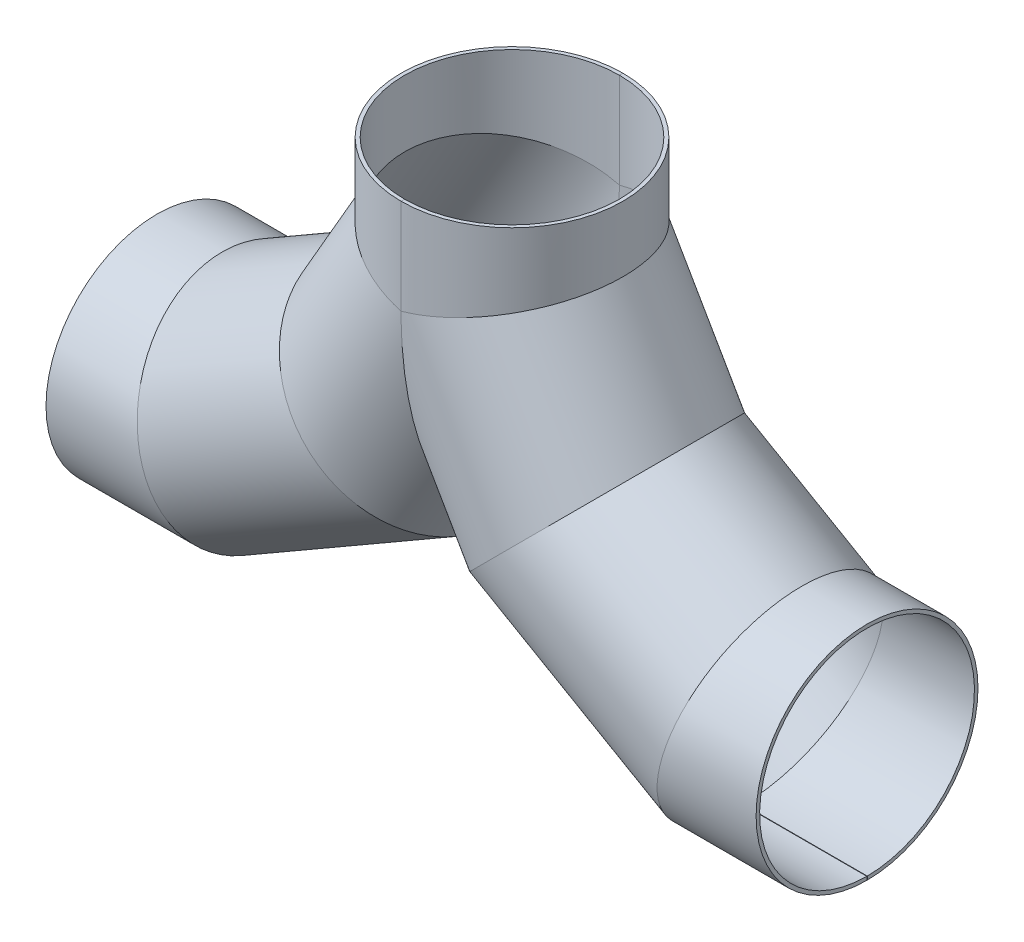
ISO-10303-21;
HEADER;
FILE_DESCRIPTION(('STEP AP214'),'2;1');
FILE_NAME('part.step','',(''),(''),'','','');
FILE_SCHEMA(('AUTOMOTIVE_DESIGN { 1 0 10303 214 1 1 1 1 }'));
ENDSEC;
DATA;
#1=APPLICATION_CONTEXT('core data for automotive mechanical design processes');
#2=APPLICATION_PROTOCOL_DEFINITION('international standard','automotive_design',2000,#1);
#3=PRODUCT_CONTEXT('',#1,'mechanical');
#4=PRODUCT('Part','Part','',(#3));
#5=PRODUCT_RELATED_PRODUCT_CATEGORY('part','',(#4));
#6=PRODUCT_DEFINITION_FORMATION('','',#4);
#7=PRODUCT_DEFINITION_CONTEXT('part definition',#1,'design');
#8=PRODUCT_DEFINITION('design','',#6,#7);
#9=PRODUCT_DEFINITION_SHAPE('','',#8);
#10=(LENGTH_UNIT() NAMED_UNIT(*) SI_UNIT(.MILLI.,.METRE.));
#11=(NAMED_UNIT(*) PLANE_ANGLE_UNIT() SI_UNIT($,.RADIAN.));
#12=(NAMED_UNIT(*) SI_UNIT($,.STERADIAN.) SOLID_ANGLE_UNIT());
#13=UNCERTAINTY_MEASURE_WITH_UNIT(LENGTH_MEASURE(1.E-05),#10,'distance_accuracy_value','');
#14=(GEOMETRIC_REPRESENTATION_CONTEXT(3) GLOBAL_UNCERTAINTY_ASSIGNED_CONTEXT((#13)) GLOBAL_UNIT_ASSIGNED_CONTEXT((#10,
#11,#12)) REPRESENTATION_CONTEXT('',''));
#15=CARTESIAN_POINT('',(0.,0.,0.));
#16=DIRECTION('',(0.,0.,1.));
#17=DIRECTION('',(1.,0.,0.));
#18=AXIS2_PLACEMENT_3D('',#15,#16,#17);
#19=CARTESIAN_POINT('',(0.,-1050.,2271.05453316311));
#20=DIRECTION('',(1.,0.,0.));
#21=DIRECTION('',(0.,0.,1.));
#22=AXIS2_PLACEMENT_3D('',#19,#20,#21);
#23=PLANE('',#22);
#24=DIRECTION('',(0.,1.,0.));
#25=VECTOR('',#24,1.);
#26=CARTESIAN_POINT('',(0.,-281.346652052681,250.));
#27=LINE('',#26,#25);
#28=CARTESIAN_POINT('',(0.,0.,250.));
#29=VERTEX_POINT('',#28);
#30=CARTESIAN_POINT('',(0.,-214.3593539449,250.));
#31=VERTEX_POINT('',#30);
#32=EDGE_CURVE('E133',#29,#31,#27,.F.);
#33=ORIENTED_EDGE('',*,*,#32,.T.);
#34=DIRECTION('',(0.,0.,-1.));
#35=VECTOR('',#34,1.);
#36=CARTESIAN_POINT('',(0.,-214.3593539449,2271.05495199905));
#37=LINE('',#36,#35);
#38=CARTESIAN_POINT('',(0.,-214.3593539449,242.000000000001));
#39=VERTEX_POINT('',#38);
#40=EDGE_CURVE('E13',#31,#39,#37,.T.);
#41=ORIENTED_EDGE('',*,*,#40,.T.);
#42=DIRECTION('',(0.,1.,0.));
#43=VECTOR('',#42,1.);
#44=CARTESIAN_POINT('',(0.,-281.346652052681,242.));
#45=LINE('',#44,#43);
#46=CARTESIAN_POINT('',(0.,0.,242.));
#47=VERTEX_POINT('',#46);
#48=EDGE_CURVE('E134',#47,#39,#45,.F.);
#49=ORIENTED_EDGE('',*,*,#48,.F.);
#50=DIRECTION('',(0.,0.,-1.));
#51=VECTOR('',#50,1.);
#52=CARTESIAN_POINT('',(0.,0.,2271.05453316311));
#53=LINE('',#52,#51);
#54=EDGE_CURVE('E123',#29,#47,#53,.T.);
#55=ORIENTED_EDGE('',*,*,#54,.F.);
#56=EDGE_LOOP('',(#33,#41,#49,#55));
#57=FACE_BOUND('',#56,.T.);
#58=ADVANCED_FACE('F77',(#57),#23,.T.);
#59=CARTESIAN_POINT('',(0.,-281.346652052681,0.));
#60=DIRECTION('',(0.,1.,0.));
#61=DIRECTION('',(0.,0.,1.));
#62=AXIS2_PLACEMENT_3D('',#59,#60,#61);
#63=CYLINDRICAL_SURFACE('',#62,250.);
#64=CARTESIAN_POINT('',(0.,0.,0.));
#65=DIRECTION('',(0.,-1.,0.));
#66=DIRECTION('',(0.,0.,1.));
#67=AXIS2_PLACEMENT_3D('',#64,#65,#66);
#68=CIRCLE('',#67,250.);
#69=CARTESIAN_POINT('',(0.,0.,-250.));
#70=VERTEX_POINT('',#69);
#71=EDGE_CURVE('E119',#29,#70,#68,.T.);
#72=ORIENTED_EDGE('',*,*,#71,.T.);
#73=DIRECTION('',(0.,1.,0.));
#74=VECTOR('',#73,1.);
#75=CARTESIAN_POINT('',(0.,-281.346652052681,-250.));
#76=LINE('',#75,#74);
#77=CARTESIAN_POINT('',(0.,-214.3593539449,-249.999999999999));
#78=VERTEX_POINT('',#77);
#79=EDGE_CURVE('E140',#78,#70,#76,.T.);
#80=ORIENTED_EDGE('',*,*,#79,.F.);
#81=CARTESIAN_POINT('',(0.,-214.3593539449,0.));
#82=DIRECTION('',(0.258819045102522,0.965925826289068,0.));
#83=DIRECTION('',(-0.965925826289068,0.258819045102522,0.));
#84=AXIS2_PLACEMENT_3D('',#81,#82,#83);
#85=ELLIPSE('',#84,258.819045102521,250.);
#86=EDGE_CURVE('E137',#31,#78,#85,.F.);
#87=ORIENTED_EDGE('',*,*,#86,.F.);
#88=ORIENTED_EDGE('',*,*,#32,.F.);
#89=EDGE_LOOP('',(#72,#80,#87,#88));
#90=FACE_BOUND('',#89,.T.);
#91=ADVANCED_FACE('F79',(#90),#63,.T.);
#92=CARTESIAN_POINT('',(0.,-281.346652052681,0.));
#93=DIRECTION('',(0.,1.,0.));
#94=DIRECTION('',(0.,0.,1.));
#95=AXIS2_PLACEMENT_3D('',#92,#93,#94);
#96=CYLINDRICAL_SURFACE('',#95,242.);
#97=ORIENTED_EDGE('',*,*,#48,.T.);
#98=CARTESIAN_POINT('',(0.,-214.3593539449,0.));
#99=DIRECTION('',(0.258819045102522,0.965925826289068,0.));
#100=DIRECTION('',(-0.965925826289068,0.258819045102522,0.));
#101=AXIS2_PLACEMENT_3D('',#98,#99,#100);
#102=ELLIPSE('',#101,250.53683565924,242.);
#103=CARTESIAN_POINT('',(0.,-214.3593539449,-241.999999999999));
#104=VERTEX_POINT('',#103);
#105=EDGE_CURVE('E92',#39,#104,#102,.F.);
#106=ORIENTED_EDGE('',*,*,#105,.T.);
#107=DIRECTION('',(0.,1.,0.));
#108=VECTOR('',#107,1.);
#109=CARTESIAN_POINT('',(0.,-281.346652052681,-242.));
#110=LINE('',#109,#108);
#111=CARTESIAN_POINT('',(0.,0.,-242.));
#112=VERTEX_POINT('',#111);
#113=EDGE_CURVE('E135',#104,#112,#110,.T.);
#114=ORIENTED_EDGE('',*,*,#113,.T.);
#115=CARTESIAN_POINT('',(0.,0.,0.));
#116=DIRECTION('',(0.,-1.,0.));
#117=DIRECTION('',(-1.,0.,0.));
#118=AXIS2_PLACEMENT_3D('',#115,#116,#117);
#119=CIRCLE('',#118,242.);
#120=EDGE_CURVE('E129',#47,#112,#119,.T.);
#121=ORIENTED_EDGE('',*,*,#120,.F.);
#122=EDGE_LOOP('',(#97,#106,#114,#121));
#123=FACE_BOUND('',#122,.T.);
#124=ADVANCED_FACE('F146',(#123),#96,.F.);
#125=CARTESIAN_POINT('',(0.,0.,0.));
#126=DIRECTION('',(0.,1.,0.));
#127=DIRECTION('',(0.,0.,1.));
#128=AXIS2_PLACEMENT_3D('',#125,#126,#127);
#129=PLANE('',#128);
#130=ORIENTED_EDGE('',*,*,#71,.F.);
#131=ORIENTED_EDGE('',*,*,#54,.T.);
#132=ORIENTED_EDGE('',*,*,#120,.T.);
#133=EDGE_CURVE('E125',#112,#70,#53,.T.);
#134=ORIENTED_EDGE('',*,*,#133,.T.);
#135=EDGE_LOOP('',(#130,#131,#132,#134));
#136=FACE_BOUND('',#135,.T.);
#137=ADVANCED_FACE('F121',(#136),#129,.T.);
#138=CARTESIAN_POINT('',(-800.,0.,2271.05495199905));
#139=DIRECTION('',(-0.258819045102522,-0.965925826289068,0.));
#140=DIRECTION('',(-0.965925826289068,0.258819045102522,0.));
#141=AXIS2_PLACEMENT_3D('',#138,#139,#140);
#142=PLANE('',#141);
#143=ORIENTED_EDGE('',*,*,#86,.T.);
#144=EDGE_CURVE('E81',#104,#78,#37,.T.);
#145=ORIENTED_EDGE('',*,*,#144,.F.);
#146=ORIENTED_EDGE('',*,*,#105,.F.);
#147=ORIENTED_EDGE('',*,*,#40,.F.);
#148=EDGE_LOOP('',(#143,#145,#146,#147));
#149=FACE_BOUND('',#148,.T.);
#150=ADVANCED_FACE('F147',(#149),#142,.T.);
#151=ORIENTED_EDGE('',*,*,#79,.T.);
#152=ORIENTED_EDGE('',*,*,#133,.F.);
#153=ORIENTED_EDGE('',*,*,#113,.F.);
#154=ORIENTED_EDGE('',*,*,#144,.T.);
#155=EDGE_LOOP('',(#151,#152,#153,#154));
#156=FACE_BOUND('',#155,.T.);
#157=ADVANCED_FACE('F149',(#156),#23,.T.);
#158=CLOSED_SHELL('',(#58,#91,#124,#137,#150,#157));
#159=MANIFOLD_SOLID_BREP('B2',#158);
#160=CARTESIAN_POINT('',(33.49364905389,-156.34665205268,0.));
#161=DIRECTION('',(-0.5,-0.866025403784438,0.));
#162=DIRECTION('',(-0.866025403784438,0.500000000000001,0.));
#163=AXIS2_PLACEMENT_3D('',#160,#161,#162);
#164=CYLINDRICAL_SURFACE('',#163,250.);
#165=DIRECTION('',(-0.5,-0.866025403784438,0.));
#166=VECTOR('',#165,1.);
#167=CARTESIAN_POINT('',(249.999566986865,-281.346402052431,-0.500000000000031));
#168=LINE('',#167,#166);
#169=CARTESIAN_POINT('',(-31.3470180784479,-768.652981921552,-0.500000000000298));
#170=VERTEX_POINT('',#169);
#171=CARTESIAN_POINT('',(0.,-714.358353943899,-0.500000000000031));
#172=VERTEX_POINT('',#171);
#173=EDGE_CURVE('E278',#170,#172,#168,.F.);
#174=ORIENTED_EDGE('',*,*,#173,.F.);
#175=CARTESIAN_POINT('',(-214.359353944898,-585.640646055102,0.));
#176=DIRECTION('',(0.707106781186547,0.707106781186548,0.));
#177=DIRECTION('',(0.707106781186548,-0.707106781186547,0.));
#178=AXIS2_PLACEMENT_3D('',#175,#176,#177);
#179=ELLIPSE('',#178,258.819045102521,250.);
#180=CARTESIAN_POINT('',(-31.3470180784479,-768.652981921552,0.500000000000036));
#181=VERTEX_POINT('',#180);
#182=EDGE_CURVE('E274',#181,#170,#179,.F.);
#183=ORIENTED_EDGE('',*,*,#182,.F.);
#184=DIRECTION('',(-0.5,-0.866025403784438,0.));
#185=VECTOR('',#184,1.);
#186=CARTESIAN_POINT('',(249.999566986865,-281.346402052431,0.499999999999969));
#187=LINE('',#186,#185);
#188=CARTESIAN_POINT('',(0.,-714.358353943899,0.499999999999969));
#189=VERTEX_POINT('',#188);
#190=EDGE_CURVE('E259',#181,#189,#187,.F.);
#191=ORIENTED_EDGE('',*,*,#190,.T.);
#192=CARTESIAN_POINT('',(0.,-214.359353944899,0.));
#193=DIRECTION('',(-1.,0.,0.));
#194=DIRECTION('',(0.,-1.,0.));
#195=AXIS2_PLACEMENT_3D('',#192,#193,#194);
#196=ELLIPSE('',#195,500.,250.);
#197=CARTESIAN_POINT('',(0.,-214.3593539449,250.000000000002));
#198=VERTEX_POINT('',#197);
#199=EDGE_CURVE('E265',#198,#189,#196,.F.);
#200=ORIENTED_EDGE('',*,*,#199,.F.);
#201=CARTESIAN_POINT('',(-2.63677968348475E-13,-214.3593539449,0.));
#202=DIRECTION('',(0.258819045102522,0.965925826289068,0.));
#203=DIRECTION('',(-0.965925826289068,0.258819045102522,0.));
#204=AXIS2_PLACEMENT_3D('',#201,#202,#203);
#205=ELLIPSE('',#204,258.819045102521,250.);
#206=CARTESIAN_POINT('',(0.,-214.3593539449,-250.));
#207=VERTEX_POINT('',#206);
#208=EDGE_CURVE('E285',#198,#207,#205,.F.);
#209=ORIENTED_EDGE('',*,*,#208,.T.);
#210=EDGE_CURVE('E271',#172,#207,#196,.F.);
#211=ORIENTED_EDGE('',*,*,#210,.F.);
#212=EDGE_LOOP('',(#174,#183,#191,#200,#209,#211));
#213=FACE_BOUND('',#212,.T.);
#214=ADVANCED_FACE('F207',(#213),#164,.T.);
#215=CARTESIAN_POINT('',(33.49364905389,-156.34665205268,0.));
#216=DIRECTION('',(-0.5,-0.866025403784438,0.));
#217=DIRECTION('',(-0.866025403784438,0.500000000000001,0.));
#218=AXIS2_PLACEMENT_3D('',#215,#216,#217);
#219=CYLINDRICAL_SURFACE('',#218,242.);
#220=CARTESIAN_POINT('',(0.,-214.359353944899,0.));
#221=DIRECTION('',(-1.,0.,0.));
#222=DIRECTION('',(0.,-1.,0.));
#223=AXIS2_PLACEMENT_3D('',#220,#221,#222);
#224=ELLIPSE('',#223,484.,242.);
#225=CARTESIAN_POINT('',(0.,-698.358320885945,-0.50000000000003));
#226=VERTEX_POINT('',#225);
#227=CARTESIAN_POINT('',(0.,-214.3593539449,-242.));
#228=VERTEX_POINT('',#227);
#229=EDGE_CURVE('E299',#226,#228,#224,.F.);
#230=ORIENTED_EDGE('',*,*,#229,.T.);
#231=CARTESIAN_POINT('',(-2.63677968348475E-13,-214.3593539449,0.));
#232=DIRECTION('',(0.258819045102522,0.965925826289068,0.));
#233=DIRECTION('',(-0.965925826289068,0.258819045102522,0.));
#234=AXIS2_PLACEMENT_3D('',#231,#232,#233);
#235=ELLIPSE('',#234,250.53683565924,242.);
#236=CARTESIAN_POINT('',(0.,-214.3593539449,242.000000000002));
#237=VERTEX_POINT('',#236);
#238=EDGE_CURVE('E276',#237,#228,#235,.F.);
#239=ORIENTED_EDGE('',*,*,#238,.F.);
#240=CARTESIAN_POINT('',(0.,-698.358320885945,0.49999999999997));
#241=VERTEX_POINT('',#240);
#242=EDGE_CURVE('E269',#237,#241,#224,.F.);
#243=ORIENTED_EDGE('',*,*,#242,.T.);
#244=DIRECTION('',(-0.5,-0.866025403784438,0.));
#245=VECTOR('',#244,1.);
#246=CARTESIAN_POINT('',(243.071349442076,-277.346393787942,0.49999999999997));
#247=LINE('',#246,#245);
#248=CARTESIAN_POINT('',(-37.2034366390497,-762.79656336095,0.500000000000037));
#249=VERTEX_POINT('',#248);
#250=EDGE_CURVE('E262',#249,#241,#247,.F.);
#251=ORIENTED_EDGE('',*,*,#250,.F.);
#252=CARTESIAN_POINT('',(-214.359353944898,-585.640646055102,0.));
#253=DIRECTION('',(0.707106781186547,0.707106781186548,0.));
#254=DIRECTION('',(0.707106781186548,-0.707106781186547,0.));
#255=AXIS2_PLACEMENT_3D('',#252,#253,#254);
#256=ELLIPSE('',#255,250.53683565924,242.);
#257=CARTESIAN_POINT('',(-37.2034366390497,-762.79656336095,-0.500000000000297));
#258=VERTEX_POINT('',#257);
#259=EDGE_CURVE('E282',#249,#258,#256,.F.);
#260=ORIENTED_EDGE('',*,*,#259,.T.);
#261=DIRECTION('',(-0.5,-0.866025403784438,0.));
#262=VECTOR('',#261,1.);
#263=CARTESIAN_POINT('',(243.071349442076,-277.346393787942,-0.50000000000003));
#264=LINE('',#263,#262);
#265=EDGE_CURVE('E309',#258,#226,#264,.F.);
#266=ORIENTED_EDGE('',*,*,#265,.T.);
#267=EDGE_LOOP('',(#230,#239,#243,#251,#260,#266));
#268=FACE_BOUND('',#267,.T.);
#269=ADVANCED_FACE('F296',(#268),#219,.F.);
#270=CARTESIAN_POINT('',(-800.,0.,2271.05495199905));
#271=DIRECTION('',(-0.258819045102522,-0.965925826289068,0.));
#272=DIRECTION('',(-0.965925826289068,0.258819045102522,0.));
#273=AXIS2_PLACEMENT_3D('',#270,#271,#272);
#274=PLANE('',#273);
#275=DIRECTION('',(0.,0.,-1.));
#276=VECTOR('',#275,1.);
#277=CARTESIAN_POINT('',(0.,-214.3593539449,2271.05495199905));
#278=LINE('',#277,#276);
#279=EDGE_CURVE('E221',#198,#237,#278,.T.);
#280=ORIENTED_EDGE('',*,*,#279,.T.);
#281=ORIENTED_EDGE('',*,*,#238,.T.);
#282=EDGE_CURVE('E303',#228,#207,#278,.T.);
#283=ORIENTED_EDGE('',*,*,#282,.T.);
#284=ORIENTED_EDGE('',*,*,#208,.F.);
#285=EDGE_LOOP('',(#280,#281,#283,#284));
#286=FACE_BOUND('',#285,.T.);
#287=ADVANCED_FACE('F314',(#286),#274,.F.);
#288=CARTESIAN_POINT('',(155.320323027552,54.6633369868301,-0.5));
#289=DIRECTION('',(0.,0.,1.));
#290=DIRECTION('',(-1.,0.,0.));
#291=AXIS2_PLACEMENT_3D('',#288,#289,#290);
#292=PLANE('',#291);
#293=ORIENTED_EDGE('',*,*,#265,.F.);
#294=DIRECTION('',(0.707106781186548,-0.707106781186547,0.));
#295=VECTOR('',#294,1.);
#296=CARTESIAN_POINT('',(-800.,1.93782600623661E-13,-0.500000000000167));
#297=LINE('',#296,#295);
#298=EDGE_CURVE('E284',#258,#170,#297,.T.);
#299=ORIENTED_EDGE('',*,*,#298,.T.);
#300=ORIENTED_EDGE('',*,*,#173,.T.);
#301=DIRECTION('',(0.,-1.,0.));
#302=VECTOR('',#301,1.);
#303=CARTESIAN_POINT('',(0.,54.6633369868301,-0.499999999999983));
#304=LINE('',#303,#302);
#305=EDGE_CURVE('E300',#226,#172,#304,.T.);
#306=ORIENTED_EDGE('',*,*,#305,.F.);
#307=EDGE_LOOP('',(#293,#299,#300,#306));
#308=FACE_BOUND('',#307,.T.);
#309=ADVANCED_FACE('F312',(#308),#292,.T.);
#310=CARTESIAN_POINT('',(155.320323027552,54.6633369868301,0.5));
#311=DIRECTION('',(0.,0.,1.));
#312=DIRECTION('',(-1.,0.,0.));
#313=AXIS2_PLACEMENT_3D('',#310,#311,#312);
#314=PLANE('',#313);
#315=DIRECTION('',(0.,-1.,0.));
#316=VECTOR('',#315,1.);
#317=CARTESIAN_POINT('',(0.,54.6633369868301,0.500000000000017));
#318=LINE('',#317,#316);
#319=EDGE_CURVE('E75',#241,#189,#318,.T.);
#320=ORIENTED_EDGE('',*,*,#319,.T.);
#321=ORIENTED_EDGE('',*,*,#190,.F.);
#322=DIRECTION('',(0.707106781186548,-0.707106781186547,0.));
#323=VECTOR('',#322,1.);
#324=CARTESIAN_POINT('',(-800.,1.93697292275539E-13,0.500000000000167));
#325=LINE('',#324,#323);
#326=EDGE_CURVE('E214',#249,#181,#325,.T.);
#327=ORIENTED_EDGE('',*,*,#326,.F.);
#328=ORIENTED_EDGE('',*,*,#250,.T.);
#329=EDGE_LOOP('',(#320,#321,#327,#328));
#330=FACE_BOUND('',#329,.T.);
#331=ADVANCED_FACE('F257',(#330),#314,.F.);
#332=CARTESIAN_POINT('',(-800.,0.,2271.05495199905));
#333=DIRECTION('',(-0.707106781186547,-0.707106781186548,0.));
#334=DIRECTION('',(-0.707106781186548,0.707106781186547,0.));
#335=AXIS2_PLACEMENT_3D('',#332,#333,#334);
#336=PLANE('',#335);
#337=ORIENTED_EDGE('',*,*,#326,.T.);
#338=ORIENTED_EDGE('',*,*,#182,.T.);
#339=ORIENTED_EDGE('',*,*,#298,.F.);
#340=ORIENTED_EDGE('',*,*,#259,.F.);
#341=EDGE_LOOP('',(#337,#338,#339,#340));
#342=FACE_BOUND('',#341,.T.);
#343=ADVANCED_FACE('F291',(#342),#336,.T.);
#344=CARTESIAN_POINT('',(0.,-1050.,2271.05453316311));
#345=DIRECTION('',(1.,0.,0.));
#346=DIRECTION('',(0.,0.,1.));
#347=AXIS2_PLACEMENT_3D('',#344,#345,#346);
#348=PLANE('',#347);
#349=ORIENTED_EDGE('',*,*,#199,.T.);
#350=ORIENTED_EDGE('',*,*,#319,.F.);
#351=ORIENTED_EDGE('',*,*,#242,.F.);
#352=ORIENTED_EDGE('',*,*,#279,.F.);
#353=EDGE_LOOP('',(#349,#350,#351,#352));
#354=FACE_BOUND('',#353,.T.);
#355=ADVANCED_FACE('F266',(#354),#348,.T.);
#356=ORIENTED_EDGE('',*,*,#229,.F.);
#357=ORIENTED_EDGE('',*,*,#305,.T.);
#358=ORIENTED_EDGE('',*,*,#210,.T.);
#359=ORIENTED_EDGE('',*,*,#282,.F.);
#360=EDGE_LOOP('',(#356,#357,#358,#359));
#361=FACE_BOUND('',#360,.T.);
#362=ADVANCED_FACE('F313',(#361),#348,.T.);
#363=CLOSED_SHELL('',(#214,#269,#287,#309,#331,#343,#355,#362));
#364=MANIFOLD_SOLID_BREP('B7',#363);
#365=CARTESIAN_POINT('',(-156.346652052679,-552.146997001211,0.));
#366=DIRECTION('',(-0.866025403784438,-0.500000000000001,0.));
#367=DIRECTION('',(-0.500000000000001,0.866025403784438,0.));
#368=AXIS2_PLACEMENT_3D('',#365,#366,#367);
#369=CYLINDRICAL_SURFACE('',#368,249.999999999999);
#370=DIRECTION('',(-0.866025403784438,-0.500000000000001,0.));
#371=VECTOR('',#370,1.);
#372=CARTESIAN_POINT('',(-31.3469020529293,-768.652914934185,0.499999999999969));
#373=LINE('',#372,#371);
#374=CARTESIAN_POINT('',(-518.65348192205,-1049.9994999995,0.500000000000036));
#375=VERTEX_POINT('',#374);
#376=CARTESIAN_POINT('',(-31.3470180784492,-768.65298192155,0.499999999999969));
#377=VERTEX_POINT('',#376);
#378=EDGE_CURVE('E457',#375,#377,#373,.F.);
#379=ORIENTED_EDGE('',*,*,#378,.T.);
#380=CARTESIAN_POINT('',(-214.359353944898,-585.640646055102,0.));
#381=DIRECTION('',(0.707106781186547,0.707106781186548,0.));
#382=DIRECTION('',(-0.707106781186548,0.707106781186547,0.));
#383=AXIS2_PLACEMENT_3D('',#380,#381,#382);
#384=ELLIPSE('',#383,258.81904510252,249.999999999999);
#385=CARTESIAN_POINT('',(-31.3470180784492,-768.65298192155,-0.500000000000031));
#386=VERTEX_POINT('',#385);
#387=EDGE_CURVE('E443',#377,#386,#384,.F.);
#388=ORIENTED_EDGE('',*,*,#387,.T.);
#389=DIRECTION('',(-0.866025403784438,-0.500000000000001,0.));
#390=VECTOR('',#389,1.);
#391=CARTESIAN_POINT('',(-31.3469020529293,-768.652914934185,-0.500000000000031));
#392=LINE('',#391,#390);
#393=CARTESIAN_POINT('',(-518.65348192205,-1049.9994999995,-0.500000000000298));
#394=VERTEX_POINT('',#393);
#395=EDGE_CURVE('E439',#394,#386,#392,.F.);
#396=ORIENTED_EDGE('',*,*,#395,.F.);
#397=CARTESIAN_POINT('',(-585.640646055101,-800.,0.));
#398=DIRECTION('',(0.965925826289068,0.258819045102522,0.));
#399=DIRECTION('',(0.258819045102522,-0.965925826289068,0.));
#400=AXIS2_PLACEMENT_3D('',#397,#398,#399);
#401=ELLIPSE('',#400,258.81904510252,249.999999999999);
#402=EDGE_CURVE('E430',#375,#394,#401,.F.);
#403=ORIENTED_EDGE('',*,*,#402,.F.);
#404=EDGE_LOOP('',(#379,#388,#396,#403));
#405=FACE_BOUND('',#404,.T.);
#406=ADVANCED_FACE('F388',(#405),#369,.T.);
#407=CARTESIAN_POINT('',(-156.346652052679,-552.146997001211,0.));
#408=DIRECTION('',(-0.866025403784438,-0.500000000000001,0.));
#409=DIRECTION('',(-0.500000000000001,0.866025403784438,0.));
#410=AXIS2_PLACEMENT_3D('',#407,#408,#409);
#411=CYLINDRICAL_SURFACE('',#410,241.999999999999);
#412=CARTESIAN_POINT('',(-585.640646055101,-800.,0.));
#413=DIRECTION('',(0.965925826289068,0.258819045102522,0.));
#414=DIRECTION('',(0.258819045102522,-0.965925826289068,0.));
#415=AXIS2_PLACEMENT_3D('',#412,#413,#414);
#416=ELLIPSE('',#415,250.536835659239,241.999999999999);
#417=CARTESIAN_POINT('',(-520.797079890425,-1041.99948347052,0.500000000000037));
#418=VERTEX_POINT('',#417);
#419=CARTESIAN_POINT('',(-520.797079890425,-1041.99948347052,-0.500000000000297));
#420=VERTEX_POINT('',#419);
#421=EDGE_CURVE('E428',#418,#420,#416,.F.);
#422=ORIENTED_EDGE('',*,*,#421,.T.);
#423=DIRECTION('',(-0.866025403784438,-0.500000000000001,0.));
#424=VECTOR('',#423,1.);
#425=CARTESIAN_POINT('',(-35.3469103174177,-761.724697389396,-0.50000000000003));
#426=LINE('',#425,#424);
#427=CARTESIAN_POINT('',(-37.203436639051,-762.796563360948,-0.50000000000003));
#428=VERTEX_POINT('',#427);
#429=EDGE_CURVE('E433',#420,#428,#426,.F.);
#430=ORIENTED_EDGE('',*,*,#429,.T.);
#431=CARTESIAN_POINT('',(-214.359353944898,-585.640646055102,0.));
#432=DIRECTION('',(0.707106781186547,0.707106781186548,0.));
#433=DIRECTION('',(-0.707106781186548,0.707106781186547,0.));
#434=AXIS2_PLACEMENT_3D('',#431,#432,#433);
#435=ELLIPSE('',#434,250.536835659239,241.999999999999);
#436=CARTESIAN_POINT('',(-37.203436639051,-762.796563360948,0.49999999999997));
#437=VERTEX_POINT('',#436);
#438=EDGE_CURVE('E446',#437,#428,#435,.F.);
#439=ORIENTED_EDGE('',*,*,#438,.F.);
#440=DIRECTION('',(-0.866025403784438,-0.500000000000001,0.));
#441=VECTOR('',#440,1.);
#442=CARTESIAN_POINT('',(-35.3469103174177,-761.724697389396,0.49999999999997));
#443=LINE('',#442,#441);
#444=EDGE_CURVE('E442',#418,#437,#443,.F.);
#445=ORIENTED_EDGE('',*,*,#444,.F.);
#446=EDGE_LOOP('',(#422,#430,#439,#445));
#447=FACE_BOUND('',#446,.T.);
#448=ADVANCED_FACE('F441',(#447),#411,.F.);
#449=CARTESIAN_POINT('',(-800.,0.,2271.05495199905));
#450=DIRECTION('',(-0.707106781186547,-0.707106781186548,0.));
#451=DIRECTION('',(-0.707106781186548,0.707106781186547,0.));
#452=AXIS2_PLACEMENT_3D('',#449,#450,#451);
#453=PLANE('',#452);
#454=ORIENTED_EDGE('',*,*,#438,.T.);
#455=DIRECTION('',(0.707106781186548,-0.707106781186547,0.));
#456=VECTOR('',#455,1.);
#457=CARTESIAN_POINT('',(-800.,1.93782600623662E-13,-0.500000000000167));
#458=LINE('',#457,#456);
#459=EDGE_CURVE('E435',#428,#386,#458,.T.);
#460=ORIENTED_EDGE('',*,*,#459,.T.);
#461=ORIENTED_EDGE('',*,*,#387,.F.);
#462=DIRECTION('',(0.707106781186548,-0.707106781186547,0.));
#463=VECTOR('',#462,1.);
#464=CARTESIAN_POINT('',(-800.,1.9369729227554E-13,0.500000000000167));
#465=LINE('',#464,#463);
#466=EDGE_CURVE('E450',#437,#377,#465,.T.);
#467=ORIENTED_EDGE('',*,*,#466,.F.);
#468=EDGE_LOOP('',(#454,#460,#461,#467));
#469=FACE_BOUND('',#468,.T.);
#470=ADVANCED_FACE('F454',(#469),#453,.F.);
#471=CARTESIAN_POINT('',(-800.,0.,2271.05495199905));
#472=DIRECTION('',(-0.965925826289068,-0.258819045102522,0.));
#473=DIRECTION('',(-0.258819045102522,0.965925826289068,0.));
#474=AXIS2_PLACEMENT_3D('',#471,#472,#473);
#475=PLANE('',#474);
#476=DIRECTION('',(0.258819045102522,-0.965925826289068,0.));
#477=VECTOR('',#476,1.);
#478=CARTESIAN_POINT('',(-800.,2.64595421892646E-13,0.500000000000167));
#479=LINE('',#478,#477);
#480=EDGE_CURVE('E205',#418,#375,#479,.T.);
#481=ORIENTED_EDGE('',*,*,#480,.T.);
#482=ORIENTED_EDGE('',*,*,#402,.T.);
#483=DIRECTION('',(0.258819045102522,-0.965925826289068,0.));
#484=VECTOR('',#483,1.);
#485=CARTESIAN_POINT('',(-800.,2.64711955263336E-13,-0.500000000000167));
#486=LINE('',#485,#484);
#487=EDGE_CURVE('E395',#420,#394,#486,.T.);
#488=ORIENTED_EDGE('',*,*,#487,.F.);
#489=ORIENTED_EDGE('',*,*,#421,.F.);
#490=EDGE_LOOP('',(#481,#482,#488,#489));
#491=FACE_BOUND('',#490,.T.);
#492=ADVANCED_FACE('F426',(#491),#475,.T.);
#493=CARTESIAN_POINT('',(387.5,-238.15698604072,-0.5));
#494=DIRECTION('',(0.,0.,1.));
#495=DIRECTION('',(0.,-1.,0.));
#496=AXIS2_PLACEMENT_3D('',#493,#494,#495);
#497=PLANE('',#496);
#498=ORIENTED_EDGE('',*,*,#459,.F.);
#499=ORIENTED_EDGE('',*,*,#429,.F.);
#500=ORIENTED_EDGE('',*,*,#487,.T.);
#501=ORIENTED_EDGE('',*,*,#395,.T.);
#502=EDGE_LOOP('',(#498,#499,#500,#501));
#503=FACE_BOUND('',#502,.T.);
#504=ADVANCED_FACE('F434',(#503),#497,.T.);
#505=CARTESIAN_POINT('',(387.5,-238.15698604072,0.5));
#506=DIRECTION('',(0.,0.,1.));
#507=DIRECTION('',(0.,-1.,0.));
#508=AXIS2_PLACEMENT_3D('',#505,#506,#507);
#509=PLANE('',#508);
#510=ORIENTED_EDGE('',*,*,#444,.T.);
#511=ORIENTED_EDGE('',*,*,#466,.T.);
#512=ORIENTED_EDGE('',*,*,#378,.F.);
#513=ORIENTED_EDGE('',*,*,#480,.F.);
#514=EDGE_LOOP('',(#510,#511,#512,#513));
#515=FACE_BOUND('',#514,.T.);
#516=ADVANCED_FACE('F458',(#515),#509,.F.);
#517=CLOSED_SHELL('',(#406,#448,#470,#492,#504,#516));
#518=MANIFOLD_SOLID_BREP('B69',#517);
#519=CARTESIAN_POINT('',(-518.653347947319,-800.,0.));
#520=DIRECTION('',(-1.,0.,0.));
#521=DIRECTION('',(0.,0.,-1.));
#522=AXIS2_PLACEMENT_3D('',#519,#520,#521);
#523=CYLINDRICAL_SURFACE('',#522,250.);
#524=DIRECTION('',(-1.,0.,0.));
#525=VECTOR('',#524,1.);
#526=CARTESIAN_POINT('',(-518.653347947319,-1049.9994999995,0.499999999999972));
#527=LINE('',#526,#525);
#528=CARTESIAN_POINT('',(-800.,-1049.9994999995,0.499999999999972));
#529=VERTEX_POINT('',#528);
#530=CARTESIAN_POINT('',(-518.65348192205,-1049.9994999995,0.50000000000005));
#531=VERTEX_POINT('',#530);
#532=EDGE_CURVE('E585',#529,#531,#527,.F.);
#533=ORIENTED_EDGE('',*,*,#532,.T.);
#534=CARTESIAN_POINT('',(-585.640646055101,-800.,0.));
#535=DIRECTION('',(0.965925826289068,0.258819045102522,0.));
#536=DIRECTION('',(-0.258819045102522,0.965925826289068,0.));
#537=AXIS2_PLACEMENT_3D('',#534,#535,#536);
#538=ELLIPSE('',#537,258.819045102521,250.);
#539=CARTESIAN_POINT('',(-518.65348192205,-1049.9994999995,-0.500000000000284));
#540=VERTEX_POINT('',#539);
#541=EDGE_CURVE('E588',#531,#540,#538,.F.);
#542=ORIENTED_EDGE('',*,*,#541,.T.);
#543=DIRECTION('',(-1.,0.,0.));
#544=VECTOR('',#543,1.);
#545=CARTESIAN_POINT('',(-518.653347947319,-1049.9994999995,-0.500000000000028));
#546=LINE('',#545,#544);
#547=CARTESIAN_POINT('',(-800.,-1049.9994999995,-0.500000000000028));
#548=VERTEX_POINT('',#547);
#549=EDGE_CURVE('E565',#548,#540,#546,.F.);
#550=ORIENTED_EDGE('',*,*,#549,.F.);
#551=CARTESIAN_POINT('',(-800.,-800.,0.));
#552=DIRECTION('',(1.,0.,0.));
#553=DIRECTION('',(0.,0.,-1.));
#554=AXIS2_PLACEMENT_3D('',#551,#552,#553);
#555=CIRCLE('',#554,250.);
#556=EDGE_CURVE('E573',#548,#529,#555,.T.);
#557=ORIENTED_EDGE('',*,*,#556,.T.);
#558=EDGE_LOOP('',(#533,#542,#550,#557));
#559=FACE_BOUND('',#558,.T.);
#560=ADVANCED_FACE('F521',(#559),#523,.T.);
#561=CARTESIAN_POINT('',(-800.,-800.,0.));
#562=DIRECTION('',(-1.,0.,0.));
#563=DIRECTION('',(0.,0.,-1.));
#564=AXIS2_PLACEMENT_3D('',#561,#562,#563);
#565=PLANE('',#564);
#566=DIRECTION('',(0.,-1.,0.));
#567=VECTOR('',#566,1.);
#568=CARTESIAN_POINT('',(-800.,-800.,0.5));
#569=LINE('',#568,#567);
#570=CARTESIAN_POINT('',(-800.,-1041.99948347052,0.499999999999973));
#571=VERTEX_POINT('',#570);
#572=EDGE_CURVE('E579',#571,#529,#569,.T.);
#573=ORIENTED_EDGE('',*,*,#572,.T.);
#574=ORIENTED_EDGE('',*,*,#556,.F.);
#575=DIRECTION('',(0.,-1.,0.));
#576=VECTOR('',#575,1.);
#577=CARTESIAN_POINT('',(-800.,-800.,-0.5));
#578=LINE('',#577,#576);
#579=CARTESIAN_POINT('',(-800.,-1041.99948347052,-0.500000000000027));
#580=VERTEX_POINT('',#579);
#581=EDGE_CURVE('E561',#580,#548,#578,.T.);
#582=ORIENTED_EDGE('',*,*,#581,.F.);
#583=CARTESIAN_POINT('',(-800.,-800.,0.));
#584=DIRECTION('',(1.,0.,0.));
#585=DIRECTION('',(0.,0.,-1.));
#586=AXIS2_PLACEMENT_3D('',#583,#584,#585);
#587=CIRCLE('',#586,242.);
#588=EDGE_CURVE('E568',#580,#571,#587,.T.);
#589=ORIENTED_EDGE('',*,*,#588,.T.);
#590=EDGE_LOOP('',(#573,#574,#582,#589));
#591=FACE_BOUND('',#590,.T.);
#592=ADVANCED_FACE('F576',(#591),#565,.T.);
#593=CARTESIAN_POINT('',(-518.653347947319,-800.,0.));
#594=DIRECTION('',(-1.,0.,0.));
#595=DIRECTION('',(0.,0.,-1.));
#596=AXIS2_PLACEMENT_3D('',#593,#594,#595);
#597=CYLINDRICAL_SURFACE('',#596,242.);
#598=ORIENTED_EDGE('',*,*,#588,.F.);
#599=DIRECTION('',(-1.,0.,0.));
#600=VECTOR('',#599,1.);
#601=CARTESIAN_POINT('',(-518.653347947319,-1041.99948347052,-0.500000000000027));
#602=LINE('',#601,#600);
#603=CARTESIAN_POINT('',(-520.797079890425,-1041.99948347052,-0.500000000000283));
#604=VERTEX_POINT('',#603);
#605=EDGE_CURVE('E557',#580,#604,#602,.F.);
#606=ORIENTED_EDGE('',*,*,#605,.T.);
#607=CARTESIAN_POINT('',(-585.640646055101,-800.,0.));
#608=DIRECTION('',(0.965925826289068,0.258819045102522,0.));
#609=DIRECTION('',(-0.258819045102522,0.965925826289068,0.));
#610=AXIS2_PLACEMENT_3D('',#607,#608,#609);
#611=ELLIPSE('',#610,250.53683565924,242.);
#612=CARTESIAN_POINT('',(-520.797079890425,-1041.99948347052,0.500000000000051));
#613=VERTEX_POINT('',#612);
#614=EDGE_CURVE('E574',#613,#604,#611,.F.);
#615=ORIENTED_EDGE('',*,*,#614,.F.);
#616=DIRECTION('',(-1.,0.,0.));
#617=VECTOR('',#616,1.);
#618=CARTESIAN_POINT('',(-518.653347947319,-1041.99948347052,0.499999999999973));
#619=LINE('',#618,#617);
#620=EDGE_CURVE('E570',#571,#613,#619,.F.);
#621=ORIENTED_EDGE('',*,*,#620,.F.);
#622=EDGE_LOOP('',(#598,#606,#615,#621));
#623=FACE_BOUND('',#622,.T.);
#624=ADVANCED_FACE('F569',(#623),#597,.F.);
#625=CARTESIAN_POINT('',(-800.,0.,2271.05495199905));
#626=DIRECTION('',(-0.965925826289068,-0.258819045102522,0.));
#627=DIRECTION('',(-0.258819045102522,0.965925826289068,0.));
#628=AXIS2_PLACEMENT_3D('',#625,#626,#627);
#629=PLANE('',#628);
#630=ORIENTED_EDGE('',*,*,#614,.T.);
#631=DIRECTION('',(0.258819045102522,-0.965925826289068,0.));
#632=VECTOR('',#631,1.);
#633=CARTESIAN_POINT('',(-800.,2.35299515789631E-13,-0.500000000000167));
#634=LINE('',#633,#632);
#635=EDGE_CURVE('E528',#604,#540,#634,.T.);
#636=ORIENTED_EDGE('',*,*,#635,.T.);
#637=ORIENTED_EDGE('',*,*,#541,.F.);
#638=DIRECTION('',(0.258819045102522,-0.965925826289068,0.));
#639=VECTOR('',#638,1.);
#640=CARTESIAN_POINT('',(-800.,2.3519593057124E-13,0.500000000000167));
#641=LINE('',#640,#639);
#642=EDGE_CURVE('E386',#613,#531,#641,.T.);
#643=ORIENTED_EDGE('',*,*,#642,.F.);
#644=EDGE_LOOP('',(#630,#636,#637,#643));
#645=FACE_BOUND('',#644,.T.);
#646=ADVANCED_FACE('F593',(#645),#629,.F.);
#647=CARTESIAN_POINT('',(250.,-800.,-0.5));
#648=DIRECTION('',(0.,0.,1.));
#649=DIRECTION('',(0.,-1.,0.));
#650=AXIS2_PLACEMENT_3D('',#647,#648,#649);
#651=PLANE('',#650);
#652=ORIENTED_EDGE('',*,*,#581,.T.);
#653=ORIENTED_EDGE('',*,*,#549,.T.);
#654=ORIENTED_EDGE('',*,*,#635,.F.);
#655=ORIENTED_EDGE('',*,*,#605,.F.);
#656=EDGE_LOOP('',(#652,#653,#654,#655));
#657=FACE_BOUND('',#656,.T.);
#658=ADVANCED_FACE('F559',(#657),#651,.T.);
#659=CARTESIAN_POINT('',(250.,-800.,0.5));
#660=DIRECTION('',(0.,0.,1.));
#661=DIRECTION('',(0.,-1.,0.));
#662=AXIS2_PLACEMENT_3D('',#659,#660,#661);
#663=PLANE('',#662);
#664=ORIENTED_EDGE('',*,*,#532,.F.);
#665=ORIENTED_EDGE('',*,*,#572,.F.);
#666=ORIENTED_EDGE('',*,*,#620,.T.);
#667=ORIENTED_EDGE('',*,*,#642,.T.);
#668=EDGE_LOOP('',(#664,#665,#666,#667));
#669=FACE_BOUND('',#668,.T.);
#670=ADVANCED_FACE('F595',(#669),#663,.F.);
#671=CLOSED_SHELL('',(#560,#592,#624,#646,#658,#670));
#672=MANIFOLD_SOLID_BREP('B199',#671);
#673=CARTESIAN_POINT('',(518.653347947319,-800.,0.));
#674=DIRECTION('',(1.,0.,0.));
#675=DIRECTION('',(0.,0.,-1.));
#676=AXIS2_PLACEMENT_3D('',#673,#674,#675);
#677=CYLINDRICAL_SURFACE('',#676,250.);
#678=DIRECTION('',(1.,0.,0.));
#679=VECTOR('',#678,1.);
#680=CARTESIAN_POINT('',(518.653347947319,-1049.9994999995,0.499999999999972));
#681=LINE('',#680,#679);
#682=CARTESIAN_POINT('',(800.,-1049.9994999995,0.499999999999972));
#683=VERTEX_POINT('',#682);
#684=CARTESIAN_POINT('',(518.65348192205,-1049.9994999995,0.50000000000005));
#685=VERTEX_POINT('',#684);
#686=EDGE_CURVE('E676',#683,#685,#681,.F.);
#687=ORIENTED_EDGE('',*,*,#686,.F.);
#688=CARTESIAN_POINT('',(800.,-800.,0.));
#689=DIRECTION('',(1.,0.,0.));
#690=DIRECTION('',(0.,0.,-1.));
#691=AXIS2_PLACEMENT_3D('',#688,#689,#690);
#692=CIRCLE('',#691,250.);
#693=CARTESIAN_POINT('',(800.,-1049.9994999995,-0.500000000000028));
#694=VERTEX_POINT('',#693);
#695=EDGE_CURVE('E712',#694,#683,#692,.T.);
#696=ORIENTED_EDGE('',*,*,#695,.F.);
#697=DIRECTION('',(1.,0.,0.));
#698=VECTOR('',#697,1.);
#699=CARTESIAN_POINT('',(518.653347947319,-1049.9994999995,-0.500000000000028));
#700=LINE('',#699,#698);
#701=CARTESIAN_POINT('',(518.65348192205,-1049.9994999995,-0.500000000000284));
#702=VERTEX_POINT('',#701);
#703=EDGE_CURVE('E694',#694,#702,#700,.F.);
#704=ORIENTED_EDGE('',*,*,#703,.T.);
#705=CARTESIAN_POINT('',(585.640646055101,-800.,0.));
#706=DIRECTION('',(0.965925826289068,-0.258819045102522,0.));
#707=DIRECTION('',(0.258819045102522,0.965925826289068,0.));
#708=AXIS2_PLACEMENT_3D('',#705,#706,#707);
#709=ELLIPSE('',#708,258.819045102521,250.);
#710=EDGE_CURVE('E714',#685,#702,#709,.F.);
#711=ORIENTED_EDGE('',*,*,#710,.F.);
#712=EDGE_LOOP('',(#687,#696,#704,#711));
#713=FACE_BOUND('',#712,.T.);
#714=ADVANCED_FACE('F654',(#713),#677,.T.);
#715=CARTESIAN_POINT('',(800.,-800.,0.));
#716=DIRECTION('',(1.,0.,0.));
#717=DIRECTION('',(0.,0.,-1.));
#718=AXIS2_PLACEMENT_3D('',#715,#716,#717);
#719=PLANE('',#718);
#720=DIRECTION('',(0.,-1.,0.));
#721=VECTOR('',#720,1.);
#722=CARTESIAN_POINT('',(800.,-800.,0.5));
#723=LINE('',#722,#721);
#724=CARTESIAN_POINT('',(800.,-1041.99948347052,0.499999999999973));
#725=VERTEX_POINT('',#724);
#726=EDGE_CURVE('E699',#725,#683,#723,.T.);
#727=ORIENTED_EDGE('',*,*,#726,.F.);
#728=CARTESIAN_POINT('',(800.,-800.,0.));
#729=DIRECTION('',(1.,0.,0.));
#730=DIRECTION('',(0.,0.,-1.));
#731=AXIS2_PLACEMENT_3D('',#728,#729,#730);
#732=CIRCLE('',#731,242.);
#733=CARTESIAN_POINT('',(800.,-1041.99948347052,-0.500000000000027));
#734=VERTEX_POINT('',#733);
#735=EDGE_CURVE('E706',#734,#725,#732,.T.);
#736=ORIENTED_EDGE('',*,*,#735,.F.);
#737=DIRECTION('',(0.,-1.,0.));
#738=VECTOR('',#737,1.);
#739=CARTESIAN_POINT('',(800.,-800.,-0.5));
#740=LINE('',#739,#738);
#741=EDGE_CURVE('E691',#734,#694,#740,.T.);
#742=ORIENTED_EDGE('',*,*,#741,.T.);
#743=ORIENTED_EDGE('',*,*,#695,.T.);
#744=EDGE_LOOP('',(#727,#736,#742,#743));
#745=FACE_BOUND('',#744,.T.);
#746=ADVANCED_FACE('F711',(#745),#719,.T.);
#747=CARTESIAN_POINT('',(518.653347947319,-800.,0.));
#748=DIRECTION('',(1.,0.,0.));
#749=DIRECTION('',(0.,0.,-1.));
#750=AXIS2_PLACEMENT_3D('',#747,#748,#749);
#751=CYLINDRICAL_SURFACE('',#750,242.);
#752=ORIENTED_EDGE('',*,*,#735,.T.);
#753=DIRECTION('',(1.,0.,0.));
#754=VECTOR('',#753,1.);
#755=CARTESIAN_POINT('',(518.653347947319,-1041.99948347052,0.499999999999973));
#756=LINE('',#755,#754);
#757=CARTESIAN_POINT('',(520.797079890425,-1041.99948347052,0.500000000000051));
#758=VERTEX_POINT('',#757);
#759=EDGE_CURVE('E724',#725,#758,#756,.F.);
#760=ORIENTED_EDGE('',*,*,#759,.T.);
#761=CARTESIAN_POINT('',(585.640646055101,-800.,0.));
#762=DIRECTION('',(0.965925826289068,-0.258819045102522,0.));
#763=DIRECTION('',(0.258819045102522,0.965925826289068,0.));
#764=AXIS2_PLACEMENT_3D('',#761,#762,#763);
#765=ELLIPSE('',#764,250.53683565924,242.);
#766=CARTESIAN_POINT('',(520.797079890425,-1041.99948347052,-0.500000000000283));
#767=VERTEX_POINT('',#766);
#768=EDGE_CURVE('E708',#758,#767,#765,.F.);
#769=ORIENTED_EDGE('',*,*,#768,.T.);
#770=DIRECTION('',(1.,0.,0.));
#771=VECTOR('',#770,1.);
#772=CARTESIAN_POINT('',(518.653347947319,-1041.99948347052,-0.500000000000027));
#773=LINE('',#772,#771);
#774=EDGE_CURVE('E668',#734,#767,#773,.F.);
#775=ORIENTED_EDGE('',*,*,#774,.F.);
#776=EDGE_LOOP('',(#752,#760,#769,#775));
#777=FACE_BOUND('',#776,.T.);
#778=ADVANCED_FACE('F704',(#777),#751,.F.);
#779=CARTESIAN_POINT('',(800.,0.,2271.05495199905));
#780=DIRECTION('',(0.965925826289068,-0.258819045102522,0.));
#781=DIRECTION('',(0.258819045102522,0.965925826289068,0.));
#782=AXIS2_PLACEMENT_3D('',#779,#780,#781);
#783=PLANE('',#782);
#784=ORIENTED_EDGE('',*,*,#768,.F.);
#785=DIRECTION('',(-0.258819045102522,-0.965925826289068,0.));
#786=VECTOR('',#785,1.);
#787=CARTESIAN_POINT('',(800.,2.3519593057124E-13,0.500000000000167));
#788=LINE('',#787,#786);
#789=EDGE_CURVE('E519',#758,#685,#788,.T.);
#790=ORIENTED_EDGE('',*,*,#789,.T.);
#791=ORIENTED_EDGE('',*,*,#710,.T.);
#792=DIRECTION('',(-0.258819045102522,-0.965925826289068,0.));
#793=VECTOR('',#792,1.);
#794=CARTESIAN_POINT('',(800.,2.35299515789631E-13,-0.500000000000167));
#795=LINE('',#794,#793);
#796=EDGE_CURVE('E661',#767,#702,#795,.T.);
#797=ORIENTED_EDGE('',*,*,#796,.F.);
#798=EDGE_LOOP('',(#784,#790,#791,#797));
#799=FACE_BOUND('',#798,.T.);
#800=ADVANCED_FACE('F722',(#799),#783,.F.);
#801=CARTESIAN_POINT('',(-250.,-800.,-0.5));
#802=DIRECTION('',(0.,0.,1.));
#803=DIRECTION('',(0.,-1.,0.));
#804=AXIS2_PLACEMENT_3D('',#801,#802,#803);
#805=PLANE('',#804);
#806=ORIENTED_EDGE('',*,*,#741,.F.);
#807=ORIENTED_EDGE('',*,*,#774,.T.);
#808=ORIENTED_EDGE('',*,*,#796,.T.);
#809=ORIENTED_EDGE('',*,*,#703,.F.);
#810=EDGE_LOOP('',(#806,#807,#808,#809));
#811=FACE_BOUND('',#810,.T.);
#812=ADVANCED_FACE('F692',(#811),#805,.T.);
#813=CARTESIAN_POINT('',(-250.,-800.,0.5));
#814=DIRECTION('',(0.,0.,1.));
#815=DIRECTION('',(0.,-1.,0.));
#816=AXIS2_PLACEMENT_3D('',#813,#814,#815);
#817=PLANE('',#816);
#818=ORIENTED_EDGE('',*,*,#686,.T.);
#819=ORIENTED_EDGE('',*,*,#789,.F.);
#820=ORIENTED_EDGE('',*,*,#759,.F.);
#821=ORIENTED_EDGE('',*,*,#726,.T.);
#822=EDGE_LOOP('',(#818,#819,#820,#821));
#823=FACE_BOUND('',#822,.T.);
#824=ADVANCED_FACE('F728',(#823),#817,.F.);
#825=CLOSED_SHELL('',(#714,#746,#778,#800,#812,#824));
#826=MANIFOLD_SOLID_BREP('B380',#825);
#827=CARTESIAN_POINT('',(156.346652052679,-552.146997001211,0.));
#828=DIRECTION('',(0.866025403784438,-0.500000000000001,0.));
#829=DIRECTION('',(0.500000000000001,0.866025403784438,0.));
#830=AXIS2_PLACEMENT_3D('',#827,#828,#829);
#831=CYLINDRICAL_SURFACE('',#830,249.999999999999);
#832=DIRECTION('',(0.866025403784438,-0.500000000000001,0.));
#833=VECTOR('',#832,1.);
#834=CARTESIAN_POINT('',(31.3469020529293,-768.652914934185,0.499999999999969));
#835=LINE('',#834,#833);
#836=CARTESIAN_POINT('',(518.65348192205,-1049.9994999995,0.500000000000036));
#837=VERTEX_POINT('',#836);
#838=CARTESIAN_POINT('',(31.3470180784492,-768.65298192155,0.499999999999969));
#839=VERTEX_POINT('',#838);
#840=EDGE_CURVE('E853',#837,#839,#835,.F.);
#841=ORIENTED_EDGE('',*,*,#840,.F.);
#842=CARTESIAN_POINT('',(585.640646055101,-800.,0.));
#843=DIRECTION('',(0.965925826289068,-0.258819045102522,0.));
#844=DIRECTION('',(-0.258819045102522,-0.965925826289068,0.));
#845=AXIS2_PLACEMENT_3D('',#842,#843,#844);
#846=ELLIPSE('',#845,258.81904510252,249.999999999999);
#847=CARTESIAN_POINT('',(518.65348192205,-1049.9994999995,-0.500000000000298));
#848=VERTEX_POINT('',#847);
#849=EDGE_CURVE('E848',#837,#848,#846,.F.);
#850=ORIENTED_EDGE('',*,*,#849,.T.);
#851=DIRECTION('',(0.866025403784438,-0.500000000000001,0.));
#852=VECTOR('',#851,1.);
#853=CARTESIAN_POINT('',(31.3469020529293,-768.652914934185,-0.500000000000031));
#854=LINE('',#853,#852);
#855=CARTESIAN_POINT('',(31.3470180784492,-768.65298192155,-0.500000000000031));
#856=VERTEX_POINT('',#855);
#857=EDGE_CURVE('E808',#848,#856,#854,.F.);
#858=ORIENTED_EDGE('',*,*,#857,.T.);
#859=CARTESIAN_POINT('',(214.359353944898,-585.640646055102,0.));
#860=DIRECTION('',(0.707106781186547,-0.707106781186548,0.));
#861=DIRECTION('',(0.707106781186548,0.707106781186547,0.));
#862=AXIS2_PLACEMENT_3D('',#859,#860,#861);
#863=ELLIPSE('',#862,258.81904510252,249.999999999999);
#864=EDGE_CURVE('E840',#839,#856,#863,.F.);
#865=ORIENTED_EDGE('',*,*,#864,.F.);
#866=EDGE_LOOP('',(#841,#850,#858,#865));
#867=FACE_BOUND('',#866,.T.);
#868=ADVANCED_FACE('F787',(#867),#831,.T.);
#869=CARTESIAN_POINT('',(156.346652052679,-552.146997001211,0.));
#870=DIRECTION('',(0.866025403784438,-0.500000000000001,0.));
#871=DIRECTION('',(0.500000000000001,0.866025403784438,0.));
#872=AXIS2_PLACEMENT_3D('',#869,#870,#871);
#873=CYLINDRICAL_SURFACE('',#872,241.999999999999);
#874=CARTESIAN_POINT('',(585.640646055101,-800.,0.));
#875=DIRECTION('',(0.965925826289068,-0.258819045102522,0.));
#876=DIRECTION('',(-0.258819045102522,-0.965925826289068,0.));
#877=AXIS2_PLACEMENT_3D('',#874,#875,#876);
#878=ELLIPSE('',#877,250.536835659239,241.999999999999);
#879=CARTESIAN_POINT('',(520.797079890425,-1041.99948347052,0.500000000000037));
#880=VERTEX_POINT('',#879);
#881=CARTESIAN_POINT('',(520.797079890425,-1041.99948347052,-0.500000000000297));
#882=VERTEX_POINT('',#881);
#883=EDGE_CURVE('E831',#880,#882,#878,.F.);
#884=ORIENTED_EDGE('',*,*,#883,.F.);
#885=DIRECTION('',(0.866025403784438,-0.500000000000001,0.));
#886=VECTOR('',#885,1.);
#887=CARTESIAN_POINT('',(35.3469103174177,-761.724697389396,0.49999999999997));
#888=LINE('',#887,#886);
#889=CARTESIAN_POINT('',(37.203436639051,-762.796563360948,0.49999999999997));
#890=VERTEX_POINT('',#889);
#891=EDGE_CURVE('E800',#880,#890,#888,.F.);
#892=ORIENTED_EDGE('',*,*,#891,.T.);
#893=CARTESIAN_POINT('',(214.359353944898,-585.640646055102,0.));
#894=DIRECTION('',(0.707106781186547,-0.707106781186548,0.));
#895=DIRECTION('',(0.707106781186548,0.707106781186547,0.));
#896=AXIS2_PLACEMENT_3D('',#893,#894,#895);
#897=ELLIPSE('',#896,250.536835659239,241.999999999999);
#898=CARTESIAN_POINT('',(37.203436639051,-762.796563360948,-0.50000000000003));
#899=VERTEX_POINT('',#898);
#900=EDGE_CURVE('E837',#890,#899,#897,.F.);
#901=ORIENTED_EDGE('',*,*,#900,.T.);
#902=DIRECTION('',(0.866025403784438,-0.500000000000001,0.));
#903=VECTOR('',#902,1.);
#904=CARTESIAN_POINT('',(35.3469103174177,-761.724697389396,-0.50000000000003));
#905=LINE('',#904,#903);
#906=EDGE_CURVE('E825',#882,#899,#905,.F.);
#907=ORIENTED_EDGE('',*,*,#906,.F.);
#908=EDGE_LOOP('',(#884,#892,#901,#907));
#909=FACE_BOUND('',#908,.T.);
#910=ADVANCED_FACE('F835',(#909),#873,.F.);
#911=CARTESIAN_POINT('',(800.,0.,2271.05495199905));
#912=DIRECTION('',(0.707106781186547,-0.707106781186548,0.));
#913=DIRECTION('',(0.707106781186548,0.707106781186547,0.));
#914=AXIS2_PLACEMENT_3D('',#911,#912,#913);
#915=PLANE('',#914);
#916=ORIENTED_EDGE('',*,*,#900,.F.);
#917=DIRECTION('',(-0.707106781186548,-0.707106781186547,0.));
#918=VECTOR('',#917,1.);
#919=CARTESIAN_POINT('',(800.,1.9369729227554E-13,0.500000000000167));
#920=LINE('',#919,#918);
#921=EDGE_CURVE('E846',#890,#839,#920,.T.);
#922=ORIENTED_EDGE('',*,*,#921,.T.);
#923=ORIENTED_EDGE('',*,*,#864,.T.);
#924=DIRECTION('',(-0.707106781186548,-0.707106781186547,0.));
#925=VECTOR('',#924,1.);
#926=CARTESIAN_POINT('',(800.,1.93782600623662E-13,-0.500000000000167));
#927=LINE('',#926,#925);
#928=EDGE_CURVE('E856',#899,#856,#927,.T.);
#929=ORIENTED_EDGE('',*,*,#928,.F.);
#930=EDGE_LOOP('',(#916,#922,#923,#929));
#931=FACE_BOUND('',#930,.T.);
#932=ADVANCED_FACE('F860',(#931),#915,.F.);
#933=CARTESIAN_POINT('',(800.,0.,2271.05495199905));
#934=DIRECTION('',(0.965925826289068,-0.258819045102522,0.));
#935=DIRECTION('',(0.258819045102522,0.965925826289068,0.));
#936=AXIS2_PLACEMENT_3D('',#933,#934,#935);
#937=PLANE('',#936);
#938=DIRECTION('',(-0.258819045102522,-0.965925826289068,0.));
#939=VECTOR('',#938,1.);
#940=CARTESIAN_POINT('',(800.,2.64595421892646E-13,0.500000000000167));
#941=LINE('',#940,#939);
#942=EDGE_CURVE('E652',#880,#837,#941,.T.);
#943=ORIENTED_EDGE('',*,*,#942,.F.);
#944=ORIENTED_EDGE('',*,*,#883,.T.);
#945=DIRECTION('',(-0.258819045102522,-0.965925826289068,0.));
#946=VECTOR('',#945,1.);
#947=CARTESIAN_POINT('',(800.,2.64711955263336E-13,-0.500000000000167));
#948=LINE('',#947,#946);
#949=EDGE_CURVE('E794',#882,#848,#948,.T.);
#950=ORIENTED_EDGE('',*,*,#949,.T.);
#951=ORIENTED_EDGE('',*,*,#849,.F.);
#952=EDGE_LOOP('',(#943,#944,#950,#951));
#953=FACE_BOUND('',#952,.T.);
#954=ADVANCED_FACE('F839',(#953),#937,.T.);
#955=CARTESIAN_POINT('',(-387.5,-238.15698604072,-0.5));
#956=DIRECTION('',(0.,0.,1.));
#957=DIRECTION('',(0.,-1.,0.));
#958=AXIS2_PLACEMENT_3D('',#955,#956,#957);
#959=PLANE('',#958);
#960=ORIENTED_EDGE('',*,*,#928,.T.);
#961=ORIENTED_EDGE('',*,*,#857,.F.);
#962=ORIENTED_EDGE('',*,*,#949,.F.);
#963=ORIENTED_EDGE('',*,*,#906,.T.);
#964=EDGE_LOOP('',(#960,#961,#962,#963));
#965=FACE_BOUND('',#964,.T.);
#966=ADVANCED_FACE('F824',(#965),#959,.T.);
#967=CARTESIAN_POINT('',(-387.5,-238.15698604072,0.5));
#968=DIRECTION('',(0.,0.,1.));
#969=DIRECTION('',(0.,-1.,0.));
#970=AXIS2_PLACEMENT_3D('',#967,#968,#969);
#971=PLANE('',#970);
#972=ORIENTED_EDGE('',*,*,#891,.F.);
#973=ORIENTED_EDGE('',*,*,#942,.T.);
#974=ORIENTED_EDGE('',*,*,#840,.T.);
#975=ORIENTED_EDGE('',*,*,#921,.F.);
#976=EDGE_LOOP('',(#972,#973,#974,#975));
#977=FACE_BOUND('',#976,.T.);
#978=ADVANCED_FACE('F894',(#977),#971,.F.);
#979=CLOSED_SHELL('',(#868,#910,#932,#954,#966,#978));
#980=MANIFOLD_SOLID_BREP('B513',#979);
#981=CARTESIAN_POINT('',(-33.49364905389,-156.34665205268,0.));
#982=DIRECTION('',(0.5,-0.866025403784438,0.));
#983=DIRECTION('',(0.866025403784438,0.500000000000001,0.));
#984=AXIS2_PLACEMENT_3D('',#981,#982,#983);
#985=CYLINDRICAL_SURFACE('',#984,250.);
#986=DIRECTION('',(0.5,-0.866025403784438,0.));
#987=VECTOR('',#986,1.);
#988=CARTESIAN_POINT('',(-249.999566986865,-281.346402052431,-0.500000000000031));
#989=LINE('',#988,#987);
#990=CARTESIAN_POINT('',(31.3470180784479,-768.652981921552,-0.500000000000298));
#991=VERTEX_POINT('',#990);
#992=CARTESIAN_POINT('',(0.,-714.358353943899,-0.500000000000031));
#993=VERTEX_POINT('',#992);
#994=EDGE_CURVE('E1007',#991,#993,#989,.F.);
#995=ORIENTED_EDGE('',*,*,#994,.T.);
#996=CARTESIAN_POINT('',(0.,-214.359353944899,0.));
#997=DIRECTION('',(-1.,0.,0.));
#998=DIRECTION('',(0.,-1.,0.));
#999=AXIS2_PLACEMENT_3D('',#996,#997,#998);
#1000=ELLIPSE('',#999,500.,250.);
#1001=CARTESIAN_POINT('',(0.,-214.3593539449,-250.));
#1002=VERTEX_POINT('',#1001);
#1003=EDGE_CURVE('E990',#993,#1002,#1000,.F.);
#1004=ORIENTED_EDGE('',*,*,#1003,.T.);
#1005=CARTESIAN_POINT('',(2.63677968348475E-13,-214.3593539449,0.));
#1006=DIRECTION('',(0.258819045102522,-0.965925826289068,0.));
#1007=DIRECTION('',(0.965925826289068,0.258819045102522,0.));
#1008=AXIS2_PLACEMENT_3D('',#1005,#1006,#1007);
#1009=ELLIPSE('',#1008,258.819045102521,250.);
#1010=CARTESIAN_POINT('',(0.,-214.3593539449,250.000000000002));
#1011=VERTEX_POINT('',#1010);
#1012=EDGE_CURVE('E987',#1011,#1002,#1009,.F.);
#1013=ORIENTED_EDGE('',*,*,#1012,.F.);
#1014=CARTESIAN_POINT('',(0.,-714.358353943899,0.499999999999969));
#1015=VERTEX_POINT('',#1014);
#1016=EDGE_CURVE('E984',#1011,#1015,#1000,.F.);
#1017=ORIENTED_EDGE('',*,*,#1016,.T.);
#1018=DIRECTION('',(0.5,-0.866025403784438,0.));
#1019=VECTOR('',#1018,1.);
#1020=CARTESIAN_POINT('',(-249.999566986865,-281.346402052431,0.499999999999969));
#1021=LINE('',#1020,#1019);
#1022=CARTESIAN_POINT('',(31.3470180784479,-768.652981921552,0.500000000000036));
#1023=VERTEX_POINT('',#1022);
#1024=EDGE_CURVE('E973',#1023,#1015,#1021,.F.);
#1025=ORIENTED_EDGE('',*,*,#1024,.F.);
#1026=CARTESIAN_POINT('',(214.359353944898,-585.640646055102,0.));
#1027=DIRECTION('',(0.707106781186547,-0.707106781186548,0.));
#1028=DIRECTION('',(-0.707106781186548,-0.707106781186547,0.));
#1029=AXIS2_PLACEMENT_3D('',#1026,#1027,#1028);
#1030=ELLIPSE('',#1029,258.819045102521,250.);
#1031=EDGE_CURVE('E980',#1023,#991,#1030,.F.);
#1032=ORIENTED_EDGE('',*,*,#1031,.T.);
#1033=EDGE_LOOP('',(#995,#1004,#1013,#1017,#1025,#1032));
#1034=FACE_BOUND('',#1033,.T.);
#1035=ADVANCED_FACE('F919',(#1034),#985,.T.);
#1036=CARTESIAN_POINT('',(-33.49364905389,-156.34665205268,0.));
#1037=DIRECTION('',(0.5,-0.866025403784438,0.));
#1038=DIRECTION('',(0.866025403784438,0.500000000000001,0.));
#1039=AXIS2_PLACEMENT_3D('',#1036,#1037,#1038);
#1040=CYLINDRICAL_SURFACE('',#1039,242.);
#1041=CARTESIAN_POINT('',(0.,-214.359353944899,0.));
#1042=DIRECTION('',(-1.,0.,0.));
#1043=DIRECTION('',(0.,-1.,0.));
#1044=AXIS2_PLACEMENT_3D('',#1041,#1042,#1043);
#1045=ELLIPSE('',#1044,484.,242.);
#1046=CARTESIAN_POINT('',(0.,-698.358320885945,-0.50000000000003));
#1047=VERTEX_POINT('',#1046);
#1048=CARTESIAN_POINT('',(0.,-214.3593539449,-242.));
#1049=VERTEX_POINT('',#1048);
#1050=EDGE_CURVE('E993',#1047,#1049,#1045,.F.);
#1051=ORIENTED_EDGE('',*,*,#1050,.F.);
#1052=DIRECTION('',(0.5,-0.866025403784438,0.));
#1053=VECTOR('',#1052,1.);
#1054=CARTESIAN_POINT('',(-243.071349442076,-277.346393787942,-0.50000000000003));
#1055=LINE('',#1054,#1053);
#1056=CARTESIAN_POINT('',(37.2034366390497,-762.79656336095,-0.500000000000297));
#1057=VERTEX_POINT('',#1056);
#1058=EDGE_CURVE('E1005',#1057,#1047,#1055,.F.);
#1059=ORIENTED_EDGE('',*,*,#1058,.F.);
#1060=CARTESIAN_POINT('',(214.359353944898,-585.640646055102,0.));
#1061=DIRECTION('',(0.707106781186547,-0.707106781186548,0.));
#1062=DIRECTION('',(-0.707106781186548,-0.707106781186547,0.));
#1063=AXIS2_PLACEMENT_3D('',#1060,#1061,#1062);
#1064=ELLIPSE('',#1063,250.53683565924,242.);
#1065=CARTESIAN_POINT('',(37.2034366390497,-762.79656336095,0.500000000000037));
#1066=VERTEX_POINT('',#1065);
#1067=EDGE_CURVE('E1010',#1066,#1057,#1064,.F.);
#1068=ORIENTED_EDGE('',*,*,#1067,.F.);
#1069=DIRECTION('',(0.5,-0.866025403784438,0.));
#1070=VECTOR('',#1069,1.);
#1071=CARTESIAN_POINT('',(-243.071349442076,-277.346393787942,0.49999999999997));
#1072=LINE('',#1071,#1070);
#1073=CARTESIAN_POINT('',(0.,-698.358320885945,0.49999999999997));
#1074=VERTEX_POINT('',#1073);
#1075=EDGE_CURVE('E981',#1066,#1074,#1072,.F.);
#1076=ORIENTED_EDGE('',*,*,#1075,.T.);
#1077=CARTESIAN_POINT('',(0.,-214.3593539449,242.000000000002));
#1078=VERTEX_POINT('',#1077);
#1079=EDGE_CURVE('E941',#1078,#1074,#1045,.F.);
#1080=ORIENTED_EDGE('',*,*,#1079,.F.);
#1081=CARTESIAN_POINT('',(2.63677968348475E-13,-214.3593539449,0.));
#1082=DIRECTION('',(0.258819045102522,-0.965925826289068,0.));
#1083=DIRECTION('',(0.965925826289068,0.258819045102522,0.));
#1084=AXIS2_PLACEMENT_3D('',#1081,#1082,#1083);
#1085=ELLIPSE('',#1084,250.53683565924,242.);
#1086=EDGE_CURVE('E1015',#1078,#1049,#1085,.F.);
#1087=ORIENTED_EDGE('',*,*,#1086,.T.);
#1088=EDGE_LOOP('',(#1051,#1059,#1068,#1076,#1080,#1087));
#1089=FACE_BOUND('',#1088,.T.);
#1090=ADVANCED_FACE('F1032',(#1089),#1040,.F.);
#1091=CARTESIAN_POINT('',(800.,0.,2271.05495199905));
#1092=DIRECTION('',(0.258819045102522,-0.965925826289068,0.));
#1093=DIRECTION('',(0.965925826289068,0.258819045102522,0.));
#1094=AXIS2_PLACEMENT_3D('',#1091,#1092,#1093);
#1095=PLANE('',#1094);
#1096=DIRECTION('',(0.,0.,-1.));
#1097=VECTOR('',#1096,1.);
#1098=CARTESIAN_POINT('',(0.,-214.3593539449,2271.05495199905));
#1099=LINE('',#1098,#1097);
#1100=EDGE_CURVE('E933',#1011,#1078,#1099,.T.);
#1101=ORIENTED_EDGE('',*,*,#1100,.F.);
#1102=ORIENTED_EDGE('',*,*,#1012,.T.);
#1103=EDGE_CURVE('E998',#1049,#1002,#1099,.T.);
#1104=ORIENTED_EDGE('',*,*,#1103,.F.);
#1105=ORIENTED_EDGE('',*,*,#1086,.F.);
#1106=EDGE_LOOP('',(#1101,#1102,#1104,#1105));
#1107=FACE_BOUND('',#1106,.T.);
#1108=ADVANCED_FACE('F1025',(#1107),#1095,.F.);
#1109=CARTESIAN_POINT('',(-155.320323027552,54.6633369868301,-0.5));
#1110=DIRECTION('',(0.,0.,1.));
#1111=DIRECTION('',(1.,0.,0.));
#1112=AXIS2_PLACEMENT_3D('',#1109,#1110,#1111);
#1113=PLANE('',#1112);
#1114=ORIENTED_EDGE('',*,*,#1058,.T.);
#1115=DIRECTION('',(0.,-1.,0.));
#1116=VECTOR('',#1115,1.);
#1117=CARTESIAN_POINT('',(0.,54.6633369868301,-0.499999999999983));
#1118=LINE('',#1117,#1116);
#1119=EDGE_CURVE('E994',#1047,#993,#1118,.T.);
#1120=ORIENTED_EDGE('',*,*,#1119,.T.);
#1121=ORIENTED_EDGE('',*,*,#994,.F.);
#1122=DIRECTION('',(-0.707106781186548,-0.707106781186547,0.));
#1123=VECTOR('',#1122,1.);
#1124=CARTESIAN_POINT('',(800.,1.93782600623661E-13,-0.500000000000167));
#1125=LINE('',#1124,#1123);
#1126=EDGE_CURVE('E1013',#1057,#991,#1125,.T.);
#1127=ORIENTED_EDGE('',*,*,#1126,.F.);
#1128=EDGE_LOOP('',(#1114,#1120,#1121,#1127));
#1129=FACE_BOUND('',#1128,.T.);
#1130=ADVANCED_FACE('F1023',(#1129),#1113,.T.);
#1131=CARTESIAN_POINT('',(-155.320323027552,54.6633369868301,0.5));
#1132=DIRECTION('',(0.,0.,1.));
#1133=DIRECTION('',(1.,0.,0.));
#1134=AXIS2_PLACEMENT_3D('',#1131,#1132,#1133);
#1135=PLANE('',#1134);
#1136=DIRECTION('',(0.,-1.,0.));
#1137=VECTOR('',#1136,1.);
#1138=CARTESIAN_POINT('',(0.,54.6633369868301,0.500000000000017));
#1139=LINE('',#1138,#1137);
#1140=EDGE_CURVE('E785',#1074,#1015,#1139,.T.);
#1141=ORIENTED_EDGE('',*,*,#1140,.F.);
#1142=ORIENTED_EDGE('',*,*,#1075,.F.);
#1143=DIRECTION('',(-0.707106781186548,-0.707106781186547,0.));
#1144=VECTOR('',#1143,1.);
#1145=CARTESIAN_POINT('',(800.,1.93697292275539E-13,0.500000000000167));
#1146=LINE('',#1145,#1144);
#1147=EDGE_CURVE('E926',#1066,#1023,#1146,.T.);
#1148=ORIENTED_EDGE('',*,*,#1147,.T.);
#1149=ORIENTED_EDGE('',*,*,#1024,.T.);
#1150=EDGE_LOOP('',(#1141,#1142,#1148,#1149));
#1151=FACE_BOUND('',#1150,.T.);
#1152=ADVANCED_FACE('F975',(#1151),#1135,.F.);
#1153=CARTESIAN_POINT('',(800.,0.,2271.05495199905));
#1154=DIRECTION('',(0.707106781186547,-0.707106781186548,0.));
#1155=DIRECTION('',(0.707106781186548,0.707106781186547,0.));
#1156=AXIS2_PLACEMENT_3D('',#1153,#1154,#1155);
#1157=PLANE('',#1156);
#1158=ORIENTED_EDGE('',*,*,#1147,.F.);
#1159=ORIENTED_EDGE('',*,*,#1067,.T.);
#1160=ORIENTED_EDGE('',*,*,#1126,.T.);
#1161=ORIENTED_EDGE('',*,*,#1031,.F.);
#1162=EDGE_LOOP('',(#1158,#1159,#1160,#1161));
#1163=FACE_BOUND('',#1162,.T.);
#1164=ADVANCED_FACE('F1020',(#1163),#1157,.T.);
#1165=CARTESIAN_POINT('',(0.,-1050.,2271.05453316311));
#1166=DIRECTION('',(-1.,0.,0.));
#1167=DIRECTION('',(0.,0.,1.));
#1168=AXIS2_PLACEMENT_3D('',#1165,#1166,#1167);
#1169=PLANE('',#1168);
#1170=ORIENTED_EDGE('',*,*,#1016,.F.);
#1171=ORIENTED_EDGE('',*,*,#1100,.T.);
#1172=ORIENTED_EDGE('',*,*,#1079,.T.);
#1173=ORIENTED_EDGE('',*,*,#1140,.T.);
#1174=EDGE_LOOP('',(#1170,#1171,#1172,#1173));
#1175=FACE_BOUND('',#1174,.T.);
#1176=ADVANCED_FACE('F991',(#1175),#1169,.T.);
#1177=ORIENTED_EDGE('',*,*,#1050,.T.);
#1178=ORIENTED_EDGE('',*,*,#1103,.T.);
#1179=ORIENTED_EDGE('',*,*,#1003,.F.);
#1180=ORIENTED_EDGE('',*,*,#1119,.F.);
#1181=EDGE_LOOP('',(#1177,#1178,#1179,#1180));
#1182=FACE_BOUND('',#1181,.T.);
#1183=ADVANCED_FACE('F1046',(#1182),#1169,.T.);
#1184=CLOSED_SHELL('',(#1035,#1090,#1108,#1130,#1152,#1164,#1176,#1183));
#1185=MANIFOLD_SOLID_BREP('B646',#1184);
#1186=CARTESIAN_POINT('',(0.,-1050.,2271.05453316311));
#1187=DIRECTION('',(-1.,0.,0.));
#1188=DIRECTION('',(0.,0.,1.));
#1189=AXIS2_PLACEMENT_3D('',#1186,#1187,#1188);
#1190=PLANE('',#1189);
#1191=DIRECTION('',(0.,1.,0.));
#1192=VECTOR('',#1191,1.);
#1193=CARTESIAN_POINT('',(0.,-281.346652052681,250.));
#1194=LINE('',#1193,#1192);
#1195=CARTESIAN_POINT('',(0.,0.,250.));
#1196=VERTEX_POINT('',#1195);
#1197=CARTESIAN_POINT('',(0.,-214.3593539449,250.));
#1198=VERTEX_POINT('',#1197);
#1199=EDGE_CURVE('E1128',#1196,#1198,#1194,.F.);
#1200=ORIENTED_EDGE('',*,*,#1199,.F.);
#1201=DIRECTION('',(0.,0.,-1.));
#1202=VECTOR('',#1201,1.);
#1203=CARTESIAN_POINT('',(0.,0.,2271.05453316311));
#1204=LINE('',#1203,#1202);
#1205=CARTESIAN_POINT('',(0.,0.,242.));
#1206=VERTEX_POINT('',#1205);
#1207=EDGE_CURVE('E1130',#1196,#1206,#1204,.T.);
#1208=ORIENTED_EDGE('',*,*,#1207,.T.);
#1209=DIRECTION('',(0.,1.,0.));
#1210=VECTOR('',#1209,1.);
#1211=CARTESIAN_POINT('',(0.,-281.346652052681,242.));
#1212=LINE('',#1211,#1210);
#1213=CARTESIAN_POINT('',(0.,-214.3593539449,242.000000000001));
#1214=VERTEX_POINT('',#1213);
#1215=EDGE_CURVE('E1105',#1206,#1214,#1212,.F.);
#1216=ORIENTED_EDGE('',*,*,#1215,.T.);
#1217=DIRECTION('',(0.,0.,-1.));
#1218=VECTOR('',#1217,1.);
#1219=CARTESIAN_POINT('',(0.,-214.3593539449,2271.05495199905));
#1220=LINE('',#1219,#1218);
#1221=EDGE_CURVE('E917',#1198,#1214,#1220,.T.);
#1222=ORIENTED_EDGE('',*,*,#1221,.F.);
#1223=EDGE_LOOP('',(#1200,#1208,#1216,#1222));
#1224=FACE_BOUND('',#1223,.T.);
#1225=ADVANCED_FACE('F1090',(#1224),#1190,.T.);
#1226=CARTESIAN_POINT('',(0.,-281.346652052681,0.));
#1227=DIRECTION('',(0.,1.,0.));
#1228=DIRECTION('',(0.,0.,1.));
#1229=AXIS2_PLACEMENT_3D('',#1226,#1227,#1228);
#1230=CYLINDRICAL_SURFACE('',#1229,250.);
#1231=CARTESIAN_POINT('',(0.,0.,0.));
#1232=DIRECTION('',(0.,1.,0.));
#1233=DIRECTION('',(0.,0.,1.));
#1234=AXIS2_PLACEMENT_3D('',#1231,#1232,#1233);
#1235=CIRCLE('',#1234,250.);
#1236=CARTESIAN_POINT('',(0.,0.,-250.));
#1237=VERTEX_POINT('',#1236);
#1238=EDGE_CURVE('E1142',#1196,#1237,#1235,.T.);
#1239=ORIENTED_EDGE('',*,*,#1238,.F.);
#1240=ORIENTED_EDGE('',*,*,#1199,.T.);
#1241=CARTESIAN_POINT('',(0.,-214.3593539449,0.));
#1242=DIRECTION('',(0.258819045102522,-0.965925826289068,0.));
#1243=DIRECTION('',(0.965925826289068,0.258819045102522,0.));
#1244=AXIS2_PLACEMENT_3D('',#1241,#1242,#1243);
#1245=ELLIPSE('',#1244,258.819045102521,250.);
#1246=CARTESIAN_POINT('',(0.,-214.3593539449,-249.999999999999));
#1247=VERTEX_POINT('',#1246);
#1248=EDGE_CURVE('E1135',#1198,#1247,#1245,.F.);
#1249=ORIENTED_EDGE('',*,*,#1248,.T.);
#1250=DIRECTION('',(0.,1.,0.));
#1251=VECTOR('',#1250,1.);
#1252=CARTESIAN_POINT('',(0.,-281.346652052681,-250.));
#1253=LINE('',#1252,#1251);
#1254=EDGE_CURVE('E1112',#1247,#1237,#1253,.T.);
#1255=ORIENTED_EDGE('',*,*,#1254,.T.);
#1256=EDGE_LOOP('',(#1239,#1240,#1249,#1255));
#1257=FACE_BOUND('',#1256,.T.);
#1258=ADVANCED_FACE('F1092',(#1257),#1230,.T.);
#1259=CARTESIAN_POINT('',(0.,-281.346652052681,0.));
#1260=DIRECTION('',(0.,1.,0.));
#1261=DIRECTION('',(0.,0.,1.));
#1262=AXIS2_PLACEMENT_3D('',#1259,#1260,#1261);
#1263=CYLINDRICAL_SURFACE('',#1262,242.);
#1264=ORIENTED_EDGE('',*,*,#1215,.F.);
#1265=CARTESIAN_POINT('',(0.,0.,0.));
#1266=DIRECTION('',(0.,1.,0.));
#1267=DIRECTION('',(1.,0.,0.));
#1268=AXIS2_PLACEMENT_3D('',#1265,#1266,#1267);
#1269=CIRCLE('',#1268,242.);
#1270=CARTESIAN_POINT('',(0.,0.,-242.));
#1271=VERTEX_POINT('',#1270);
#1272=EDGE_CURVE('E1144',#1206,#1271,#1269,.T.);
#1273=ORIENTED_EDGE('',*,*,#1272,.T.);
#1274=DIRECTION('',(0.,1.,0.));
#1275=VECTOR('',#1274,1.);
#1276=CARTESIAN_POINT('',(0.,-281.346652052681,-242.));
#1277=LINE('',#1276,#1275);
#1278=CARTESIAN_POINT('',(0.,-214.3593539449,-241.999999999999));
#1279=VERTEX_POINT('',#1278);
#1280=EDGE_CURVE('E1145',#1279,#1271,#1277,.T.);
#1281=ORIENTED_EDGE('',*,*,#1280,.F.);
#1282=CARTESIAN_POINT('',(0.,-214.3593539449,0.));
#1283=DIRECTION('',(0.258819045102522,-0.965925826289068,0.));
#1284=DIRECTION('',(0.965925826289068,0.258819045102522,0.));
#1285=AXIS2_PLACEMENT_3D('',#1282,#1283,#1284);
#1286=ELLIPSE('',#1285,250.53683565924,242.);
#1287=EDGE_CURVE('E1148',#1214,#1279,#1286,.F.);
#1288=ORIENTED_EDGE('',*,*,#1287,.F.);
#1289=EDGE_LOOP('',(#1264,#1273,#1281,#1288));
#1290=FACE_BOUND('',#1289,.T.);
#1291=ADVANCED_FACE('F1159',(#1290),#1263,.F.);
#1292=CARTESIAN_POINT('',(0.,0.,0.));
#1293=DIRECTION('',(0.,1.,0.));
#1294=DIRECTION('',(0.,0.,1.));
#1295=AXIS2_PLACEMENT_3D('',#1292,#1293,#1294);
#1296=PLANE('',#1295);
#1297=ORIENTED_EDGE('',*,*,#1238,.T.);
#1298=EDGE_CURVE('E1146',#1271,#1237,#1204,.T.);
#1299=ORIENTED_EDGE('',*,*,#1298,.F.);
#1300=ORIENTED_EDGE('',*,*,#1272,.F.);
#1301=ORIENTED_EDGE('',*,*,#1207,.F.);
#1302=EDGE_LOOP('',(#1297,#1299,#1300,#1301));
#1303=FACE_BOUND('',#1302,.T.);
#1304=ADVANCED_FACE('F1140',(#1303),#1296,.T.);
#1305=CARTESIAN_POINT('',(800.,0.,2271.05495199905));
#1306=DIRECTION('',(0.258819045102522,-0.965925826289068,0.));
#1307=DIRECTION('',(0.965925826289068,0.258819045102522,0.));
#1308=AXIS2_PLACEMENT_3D('',#1305,#1306,#1307);
#1309=PLANE('',#1308);
#1310=ORIENTED_EDGE('',*,*,#1248,.F.);
#1311=ORIENTED_EDGE('',*,*,#1221,.T.);
#1312=ORIENTED_EDGE('',*,*,#1287,.T.);
#1313=EDGE_CURVE('E1094',#1279,#1247,#1220,.T.);
#1314=ORIENTED_EDGE('',*,*,#1313,.T.);
#1315=EDGE_LOOP('',(#1310,#1311,#1312,#1314));
#1316=FACE_BOUND('',#1315,.T.);
#1317=ADVANCED_FACE('F1162',(#1316),#1309,.T.);
#1318=ORIENTED_EDGE('',*,*,#1254,.F.);
#1319=ORIENTED_EDGE('',*,*,#1313,.F.);
#1320=ORIENTED_EDGE('',*,*,#1280,.T.);
#1321=ORIENTED_EDGE('',*,*,#1298,.T.);
#1322=EDGE_LOOP('',(#1318,#1319,#1320,#1321));
#1323=FACE_BOUND('',#1322,.T.);
#1324=ADVANCED_FACE('F1156',(#1323),#1190,.T.);
#1325=CLOSED_SHELL('',(#1225,#1258,#1291,#1304,#1317,#1324));
#1326=MANIFOLD_SOLID_BREP('B779',#1325);
#1327=ADVANCED_BREP_SHAPE_REPRESENTATION('',(#18,#159,#364,#518,#672,#826,#980,#1185,#1326),#14);
#1328=SHAPE_DEFINITION_REPRESENTATION(#9,#1327);
ENDSEC;
END-ISO-10303-21;
